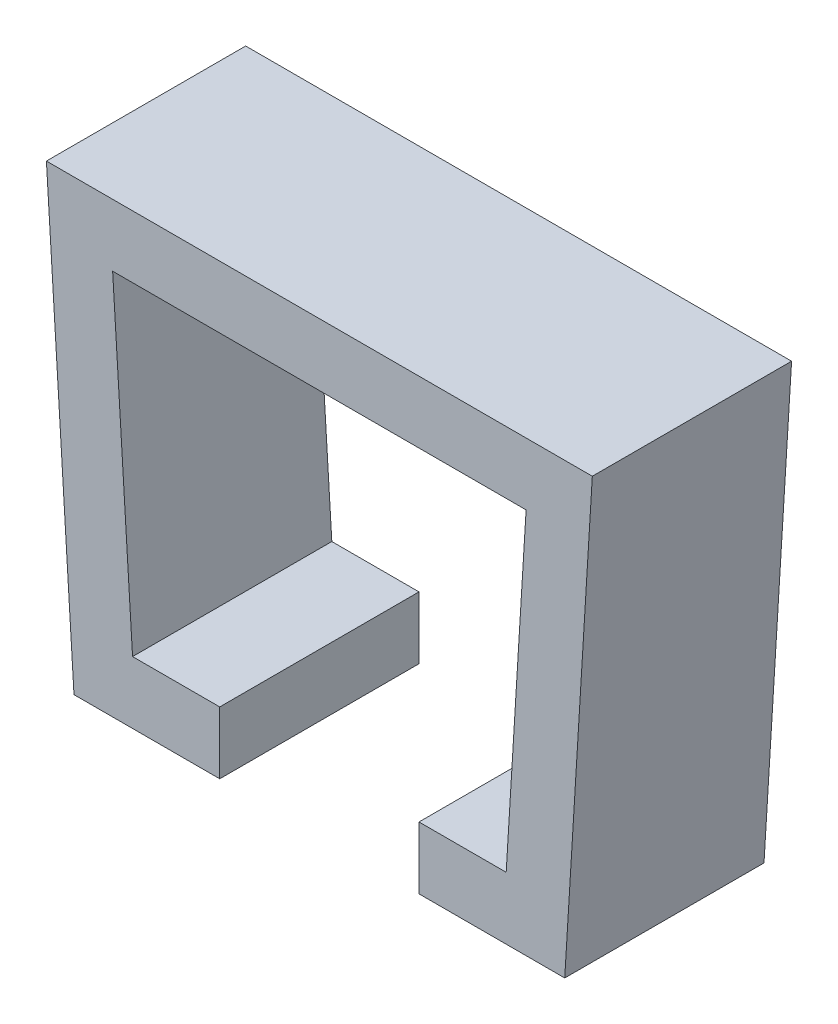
ISO-10303-21;
HEADER;
FILE_DESCRIPTION(('STEP AP214'),'2;1');
FILE_NAME('part.step','',(''),(''),'','','');
FILE_SCHEMA(('AUTOMOTIVE_DESIGN { 1 0 10303 214 1 1 1 1 }'));
ENDSEC;
DATA;
#1=APPLICATION_CONTEXT('core data for automotive mechanical design processes');
#2=APPLICATION_PROTOCOL_DEFINITION('international standard','automotive_design',2000,#1);
#3=PRODUCT_CONTEXT('',#1,'mechanical');
#4=PRODUCT('Part','Part','',(#3));
#5=PRODUCT_RELATED_PRODUCT_CATEGORY('part','',(#4));
#6=PRODUCT_DEFINITION_FORMATION('','',#4);
#7=PRODUCT_DEFINITION_CONTEXT('part definition',#1,'design');
#8=PRODUCT_DEFINITION('design','',#6,#7);
#9=PRODUCT_DEFINITION_SHAPE('','',#8);
#10=(LENGTH_UNIT() NAMED_UNIT(*) SI_UNIT(.MILLI.,.METRE.));
#11=(NAMED_UNIT(*) PLANE_ANGLE_UNIT() SI_UNIT($,.RADIAN.));
#12=(NAMED_UNIT(*) SI_UNIT($,.STERADIAN.) SOLID_ANGLE_UNIT());
#13=UNCERTAINTY_MEASURE_WITH_UNIT(LENGTH_MEASURE(1.E-05),#10,'distance_accuracy_value','');
#14=(GEOMETRIC_REPRESENTATION_CONTEXT(3) GLOBAL_UNCERTAINTY_ASSIGNED_CONTEXT((#13)) GLOBAL_UNIT_ASSIGNED_CONTEXT((#10,
#11,#12)) REPRESENTATION_CONTEXT('',''));
#15=CARTESIAN_POINT('',(0.,0.,0.));
#16=DIRECTION('',(0.,0.,1.));
#17=DIRECTION('',(1.,0.,0.));
#18=AXIS2_PLACEMENT_3D('',#15,#16,#17);
#19=CARTESIAN_POINT('',(-3.75,0.,4.));
#20=DIRECTION('',(0.,-1.,0.));
#21=DIRECTION('',(0.,0.,-1.));
#22=AXIS2_PLACEMENT_3D('',#19,#20,#21);
#23=PLANE('',#22);
#24=DIRECTION('',(-1.,0.,0.));
#25=VECTOR('',#24,1.);
#26=CARTESIAN_POINT('',(-3.75,0.,0.));
#27=LINE('',#26,#25);
#28=CARTESIAN_POINT('',(-2.,0.,0.));
#29=VERTEX_POINT('',#28);
#30=CARTESIAN_POINT('',(-3.75,0.,0.));
#31=VERTEX_POINT('',#30);
#32=EDGE_CURVE('E152',#29,#31,#27,.T.);
#33=ORIENTED_EDGE('',*,*,#32,.T.);
#34=DIRECTION('',(0.,0.,-1.));
#35=VECTOR('',#34,1.);
#36=CARTESIAN_POINT('',(-3.75,0.,4.));
#37=LINE('',#36,#35);
#38=CARTESIAN_POINT('',(-3.75,0.,4.));
#39=VERTEX_POINT('',#38);
#40=EDGE_CURVE('E11',#39,#31,#37,.T.);
#41=ORIENTED_EDGE('',*,*,#40,.F.);
#42=DIRECTION('',(-1.,0.,0.));
#43=VECTOR('',#42,1.);
#44=CARTESIAN_POINT('',(-3.75,0.,4.));
#45=LINE('',#44,#43);
#46=CARTESIAN_POINT('',(-2.,0.,4.));
#47=VERTEX_POINT('',#46);
#48=EDGE_CURVE('E174',#47,#39,#45,.T.);
#49=ORIENTED_EDGE('',*,*,#48,.F.);
#50=DIRECTION('',(0.,0.,-1.));
#51=VECTOR('',#50,1.);
#52=CARTESIAN_POINT('',(-2.,0.,4.));
#53=LINE('',#52,#51);
#54=EDGE_CURVE('E148',#47,#29,#53,.T.);
#55=ORIENTED_EDGE('',*,*,#54,.T.);
#56=EDGE_LOOP('',(#33,#41,#49,#55));
#57=FACE_BOUND('',#56,.T.);
#58=ADVANCED_FACE('F32',(#57),#23,.F.);
#59=CARTESIAN_POINT('',(-3.75,0.,4.));
#60=DIRECTION('',(-0.998111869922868,-0.0614222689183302,0.));
#61=DIRECTION('',(0.0614222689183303,-0.998111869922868,0.));
#62=AXIS2_PLACEMENT_3D('',#59,#60,#61);
#63=PLANE('',#62);
#64=DIRECTION('',(-0.0614222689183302,0.998111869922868,0.));
#65=VECTOR('',#64,1.);
#66=CARTESIAN_POINT('',(-3.75,0.,0.));
#67=LINE('',#66,#65);
#68=CARTESIAN_POINT('',(-4.15,6.5,0.));
#69=VERTEX_POINT('',#68);
#70=EDGE_CURVE('E155',#31,#69,#67,.T.);
#71=ORIENTED_EDGE('',*,*,#70,.T.);
#72=DIRECTION('',(0.,0.,-1.));
#73=VECTOR('',#72,1.);
#74=CARTESIAN_POINT('',(-4.15,6.5,4.));
#75=LINE('',#74,#73);
#76=CARTESIAN_POINT('',(-4.15,6.5,4.));
#77=VERTEX_POINT('',#76);
#78=EDGE_CURVE('E40',#77,#69,#75,.T.);
#79=ORIENTED_EDGE('',*,*,#78,.F.);
#80=DIRECTION('',(-0.0614222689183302,0.998111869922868,0.));
#81=VECTOR('',#80,1.);
#82=CARTESIAN_POINT('',(-3.75,0.,4.));
#83=LINE('',#82,#81);
#84=EDGE_CURVE('E103',#39,#77,#83,.T.);
#85=ORIENTED_EDGE('',*,*,#84,.F.);
#86=ORIENTED_EDGE('',*,*,#40,.T.);
#87=EDGE_LOOP('',(#71,#79,#85,#86));
#88=FACE_BOUND('',#87,.T.);
#89=ADVANCED_FACE('F252',(#88),#63,.F.);
#90=CARTESIAN_POINT('',(-4.15,6.5,4.));
#91=DIRECTION('',(0.,1.,0.));
#92=DIRECTION('',(0.,0.,1.));
#93=AXIS2_PLACEMENT_3D('',#90,#91,#92);
#94=PLANE('',#93);
#95=DIRECTION('',(1.,0.,0.));
#96=VECTOR('',#95,1.);
#97=CARTESIAN_POINT('',(-4.15,6.5,0.));
#98=LINE('',#97,#96);
#99=CARTESIAN_POINT('',(4.15,6.5,0.));
#100=VERTEX_POINT('',#99);
#101=EDGE_CURVE('E157',#69,#100,#98,.T.);
#102=ORIENTED_EDGE('',*,*,#101,.T.);
#103=DIRECTION('',(0.,0.,-1.));
#104=VECTOR('',#103,1.);
#105=CARTESIAN_POINT('',(4.15,6.5,4.));
#106=LINE('',#105,#104);
#107=CARTESIAN_POINT('',(4.15,6.5,4.));
#108=VERTEX_POINT('',#107);
#109=EDGE_CURVE('E193',#108,#100,#106,.T.);
#110=ORIENTED_EDGE('',*,*,#109,.F.);
#111=DIRECTION('',(1.,0.,0.));
#112=VECTOR('',#111,1.);
#113=CARTESIAN_POINT('',(-4.15,6.5,4.));
#114=LINE('',#113,#112);
#115=EDGE_CURVE('E201',#77,#108,#114,.T.);
#116=ORIENTED_EDGE('',*,*,#115,.F.);
#117=ORIENTED_EDGE('',*,*,#78,.T.);
#118=EDGE_LOOP('',(#102,#110,#116,#117));
#119=FACE_BOUND('',#118,.T.);
#120=ADVANCED_FACE('F199',(#119),#94,.F.);
#121=CARTESIAN_POINT('',(3.75,0.,4.));
#122=DIRECTION('',(0.998111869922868,-0.0614222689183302,0.));
#123=DIRECTION('',(0.0614222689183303,0.998111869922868,0.));
#124=AXIS2_PLACEMENT_3D('',#121,#122,#123);
#125=PLANE('',#124);
#126=DIRECTION('',(-0.0614222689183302,-0.998111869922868,0.));
#127=VECTOR('',#126,1.);
#128=CARTESIAN_POINT('',(3.75,0.,0.));
#129=LINE('',#128,#127);
#130=CARTESIAN_POINT('',(3.75,0.,0.));
#131=VERTEX_POINT('',#130);
#132=EDGE_CURVE('E159',#100,#131,#129,.T.);
#133=ORIENTED_EDGE('',*,*,#132,.T.);
#134=DIRECTION('',(0.,0.,-1.));
#135=VECTOR('',#134,1.);
#136=CARTESIAN_POINT('',(3.75,0.,4.));
#137=LINE('',#136,#135);
#138=CARTESIAN_POINT('',(3.75,0.,4.));
#139=VERTEX_POINT('',#138);
#140=EDGE_CURVE('E190',#139,#131,#137,.T.);
#141=ORIENTED_EDGE('',*,*,#140,.F.);
#142=DIRECTION('',(-0.0614222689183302,-0.998111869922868,0.));
#143=VECTOR('',#142,1.);
#144=CARTESIAN_POINT('',(3.75,0.,4.));
#145=LINE('',#144,#143);
#146=EDGE_CURVE('E219',#108,#139,#145,.T.);
#147=ORIENTED_EDGE('',*,*,#146,.F.);
#148=ORIENTED_EDGE('',*,*,#109,.T.);
#149=EDGE_LOOP('',(#133,#141,#147,#148));
#150=FACE_BOUND('',#149,.T.);
#151=ADVANCED_FACE('F210',(#150),#125,.F.);
#152=CARTESIAN_POINT('',(3.75,0.,4.));
#153=DIRECTION('',(0.,-1.,0.));
#154=DIRECTION('',(0.,0.,-1.));
#155=AXIS2_PLACEMENT_3D('',#152,#153,#154);
#156=PLANE('',#155);
#157=DIRECTION('',(-1.,0.,0.));
#158=VECTOR('',#157,1.);
#159=CARTESIAN_POINT('',(3.75,0.,0.));
#160=LINE('',#159,#158);
#161=CARTESIAN_POINT('',(2.,0.,0.));
#162=VERTEX_POINT('',#161);
#163=EDGE_CURVE('E161',#131,#162,#160,.T.);
#164=ORIENTED_EDGE('',*,*,#163,.T.);
#165=DIRECTION('',(0.,0.,-1.));
#166=VECTOR('',#165,1.);
#167=CARTESIAN_POINT('',(2.,0.,4.));
#168=LINE('',#167,#166);
#169=CARTESIAN_POINT('',(2.,0.,4.));
#170=VERTEX_POINT('',#169);
#171=EDGE_CURVE('E187',#170,#162,#168,.T.);
#172=ORIENTED_EDGE('',*,*,#171,.F.);
#173=DIRECTION('',(-1.,0.,0.));
#174=VECTOR('',#173,1.);
#175=CARTESIAN_POINT('',(3.75,0.,4.));
#176=LINE('',#175,#174);
#177=EDGE_CURVE('E216',#139,#170,#176,.T.);
#178=ORIENTED_EDGE('',*,*,#177,.F.);
#179=ORIENTED_EDGE('',*,*,#140,.T.);
#180=EDGE_LOOP('',(#164,#172,#178,#179));
#181=FACE_BOUND('',#180,.T.);
#182=ADVANCED_FACE('F214',(#181),#156,.F.);
#183=CARTESIAN_POINT('',(2.,0.,4.));
#184=DIRECTION('',(1.,0.,0.));
#185=DIRECTION('',(0.,0.,-1.));
#186=AXIS2_PLACEMENT_3D('',#183,#184,#185);
#187=PLANE('',#186);
#188=DIRECTION('',(0.,-1.,0.));
#189=VECTOR('',#188,1.);
#190=CARTESIAN_POINT('',(2.,0.,0.));
#191=LINE('',#190,#189);
#192=CARTESIAN_POINT('',(2.,-1.25,0.));
#193=VERTEX_POINT('',#192);
#194=EDGE_CURVE('E163',#162,#193,#191,.T.);
#195=ORIENTED_EDGE('',*,*,#194,.T.);
#196=DIRECTION('',(0.,0.,-1.));
#197=VECTOR('',#196,1.);
#198=CARTESIAN_POINT('',(2.,-1.25,4.));
#199=LINE('',#198,#197);
#200=CARTESIAN_POINT('',(2.,-1.25,4.));
#201=VERTEX_POINT('',#200);
#202=EDGE_CURVE('E184',#201,#193,#199,.T.);
#203=ORIENTED_EDGE('',*,*,#202,.F.);
#204=DIRECTION('',(0.,-1.,0.));
#205=VECTOR('',#204,1.);
#206=CARTESIAN_POINT('',(2.,0.,4.));
#207=LINE('',#206,#205);
#208=EDGE_CURVE('E218',#170,#201,#207,.T.);
#209=ORIENTED_EDGE('',*,*,#208,.F.);
#210=ORIENTED_EDGE('',*,*,#171,.T.);
#211=EDGE_LOOP('',(#195,#203,#209,#210));
#212=FACE_BOUND('',#211,.T.);
#213=ADVANCED_FACE('F265',(#212),#187,.F.);
#214=CARTESIAN_POINT('',(4.9254415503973,-1.25,4.));
#215=DIRECTION('',(0.,1.,0.));
#216=DIRECTION('',(-1.,0.,0.));
#217=AXIS2_PLACEMENT_3D('',#214,#215,#216);
#218=PLANE('',#217);
#219=DIRECTION('',(1.,0.,0.));
#220=VECTOR('',#219,1.);
#221=CARTESIAN_POINT('',(4.9254415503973,-1.25,0.));
#222=LINE('',#221,#220);
#223=CARTESIAN_POINT('',(4.9254415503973,-1.25,0.));
#224=VERTEX_POINT('',#223);
#225=EDGE_CURVE('E165',#193,#224,#222,.T.);
#226=ORIENTED_EDGE('',*,*,#225,.T.);
#227=DIRECTION('',(0.,0.,-1.));
#228=VECTOR('',#227,1.);
#229=CARTESIAN_POINT('',(4.9254415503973,-1.25,4.));
#230=LINE('',#229,#228);
#231=CARTESIAN_POINT('',(4.9254415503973,-1.25,4.));
#232=VERTEX_POINT('',#231);
#233=EDGE_CURVE('E181',#232,#224,#230,.T.);
#234=ORIENTED_EDGE('',*,*,#233,.F.);
#235=DIRECTION('',(1.,0.,0.));
#236=VECTOR('',#235,1.);
#237=CARTESIAN_POINT('',(4.9254415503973,-1.25,4.));
#238=LINE('',#237,#236);
#239=EDGE_CURVE('E221',#201,#232,#238,.T.);
#240=ORIENTED_EDGE('',*,*,#239,.F.);
#241=ORIENTED_EDGE('',*,*,#202,.T.);
#242=EDGE_LOOP('',(#226,#234,#240,#241));
#243=FACE_BOUND('',#242,.T.);
#244=ADVANCED_FACE('F268',(#243),#218,.F.);
#245=CARTESIAN_POINT('',(4.9254415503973,-1.25,4.));
#246=DIRECTION('',(-0.998111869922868,0.0614222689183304,0.));
#247=DIRECTION('',(-0.0614222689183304,-0.998111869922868,0.));
#248=AXIS2_PLACEMENT_3D('',#245,#246,#247);
#249=PLANE('',#248);
#250=DIRECTION('',(0.0614222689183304,0.998111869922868,0.));
#251=VECTOR('',#250,1.);
#252=CARTESIAN_POINT('',(4.9254415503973,-1.25,0.));
#253=LINE('',#252,#251);
#254=CARTESIAN_POINT('',(5.47928770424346,7.75,0.));
#255=VERTEX_POINT('',#254);
#256=EDGE_CURVE('E167',#224,#255,#253,.T.);
#257=ORIENTED_EDGE('',*,*,#256,.T.);
#258=DIRECTION('',(0.,0.,-1.));
#259=VECTOR('',#258,1.);
#260=CARTESIAN_POINT('',(5.47928770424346,7.75,4.));
#261=LINE('',#260,#259);
#262=CARTESIAN_POINT('',(5.47928770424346,7.75,4.));
#263=VERTEX_POINT('',#262);
#264=EDGE_CURVE('E178',#263,#255,#261,.T.);
#265=ORIENTED_EDGE('',*,*,#264,.F.);
#266=DIRECTION('',(0.0614222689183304,0.998111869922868,0.));
#267=VECTOR('',#266,1.);
#268=CARTESIAN_POINT('',(4.9254415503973,-1.25,4.));
#269=LINE('',#268,#267);
#270=EDGE_CURVE('E227',#232,#263,#269,.T.);
#271=ORIENTED_EDGE('',*,*,#270,.F.);
#272=ORIENTED_EDGE('',*,*,#233,.T.);
#273=EDGE_LOOP('',(#257,#265,#271,#272));
#274=FACE_BOUND('',#273,.T.);
#275=ADVANCED_FACE('F233',(#274),#249,.F.);
#276=CARTESIAN_POINT('',(-5.47928770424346,7.75,4.));
#277=DIRECTION('',(0.,-1.,0.));
#278=DIRECTION('',(0.,0.,-1.));
#279=AXIS2_PLACEMENT_3D('',#276,#277,#278);
#280=PLANE('',#279);
#281=DIRECTION('',(-1.,0.,0.));
#282=VECTOR('',#281,1.);
#283=CARTESIAN_POINT('',(-5.47928770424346,7.75,0.));
#284=LINE('',#283,#282);
#285=CARTESIAN_POINT('',(-5.47928770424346,7.75,0.));
#286=VERTEX_POINT('',#285);
#287=EDGE_CURVE('E169',#255,#286,#284,.T.);
#288=ORIENTED_EDGE('',*,*,#287,.T.);
#289=DIRECTION('',(0.,0.,-1.));
#290=VECTOR('',#289,1.);
#291=CARTESIAN_POINT('',(-5.47928770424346,7.75,4.));
#292=LINE('',#291,#290);
#293=CARTESIAN_POINT('',(-5.47928770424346,7.75,4.));
#294=VERTEX_POINT('',#293);
#295=EDGE_CURVE('E143',#294,#286,#292,.T.);
#296=ORIENTED_EDGE('',*,*,#295,.F.);
#297=DIRECTION('',(-1.,0.,0.));
#298=VECTOR('',#297,1.);
#299=CARTESIAN_POINT('',(-5.47928770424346,7.75,4.));
#300=LINE('',#299,#298);
#301=EDGE_CURVE('E134',#263,#294,#300,.T.);
#302=ORIENTED_EDGE('',*,*,#301,.F.);
#303=ORIENTED_EDGE('',*,*,#264,.T.);
#304=EDGE_LOOP('',(#288,#296,#302,#303));
#305=FACE_BOUND('',#304,.T.);
#306=ADVANCED_FACE('F237',(#305),#280,.F.);
#307=CARTESIAN_POINT('',(-4.9254415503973,-1.25,4.));
#308=DIRECTION('',(0.998111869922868,0.0614222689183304,0.));
#309=DIRECTION('',(-0.0614222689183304,0.998111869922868,0.));
#310=AXIS2_PLACEMENT_3D('',#307,#308,#309);
#311=PLANE('',#310);
#312=DIRECTION('',(0.0614222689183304,-0.998111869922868,0.));
#313=VECTOR('',#312,1.);
#314=CARTESIAN_POINT('',(-4.9254415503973,-1.25,0.));
#315=LINE('',#314,#313);
#316=CARTESIAN_POINT('',(-4.9254415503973,-1.25,0.));
#317=VERTEX_POINT('',#316);
#318=EDGE_CURVE('E142',#286,#317,#315,.T.);
#319=ORIENTED_EDGE('',*,*,#318,.T.);
#320=DIRECTION('',(0.,0.,-1.));
#321=VECTOR('',#320,1.);
#322=CARTESIAN_POINT('',(-4.9254415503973,-1.25,4.));
#323=LINE('',#322,#321);
#324=CARTESIAN_POINT('',(-4.9254415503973,-1.25,4.));
#325=VERTEX_POINT('',#324);
#326=EDGE_CURVE('E139',#325,#317,#323,.T.);
#327=ORIENTED_EDGE('',*,*,#326,.F.);
#328=DIRECTION('',(0.0614222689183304,-0.998111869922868,0.));
#329=VECTOR('',#328,1.);
#330=CARTESIAN_POINT('',(-4.9254415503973,-1.25,4.));
#331=LINE('',#330,#329);
#332=EDGE_CURVE('E128',#294,#325,#331,.T.);
#333=ORIENTED_EDGE('',*,*,#332,.F.);
#334=ORIENTED_EDGE('',*,*,#295,.T.);
#335=EDGE_LOOP('',(#319,#327,#333,#334));
#336=FACE_BOUND('',#335,.T.);
#337=ADVANCED_FACE('F140',(#336),#311,.F.);
#338=CARTESIAN_POINT('',(-4.9254415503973,-1.25,4.));
#339=DIRECTION('',(0.,1.,0.));
#340=DIRECTION('',(0.,0.,1.));
#341=AXIS2_PLACEMENT_3D('',#338,#339,#340);
#342=PLANE('',#341);
#343=DIRECTION('',(1.,0.,0.));
#344=VECTOR('',#343,1.);
#345=CARTESIAN_POINT('',(-4.9254415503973,-1.25,0.));
#346=LINE('',#345,#344);
#347=CARTESIAN_POINT('',(-2.,-1.25,0.));
#348=VERTEX_POINT('',#347);
#349=EDGE_CURVE('E89',#317,#348,#346,.T.);
#350=ORIENTED_EDGE('',*,*,#349,.T.);
#351=DIRECTION('',(0.,0.,-1.));
#352=VECTOR('',#351,1.);
#353=CARTESIAN_POINT('',(-2.,-1.25,4.));
#354=LINE('',#353,#352);
#355=CARTESIAN_POINT('',(-2.,-1.25,4.));
#356=VERTEX_POINT('',#355);
#357=EDGE_CURVE('E144',#356,#348,#354,.T.);
#358=ORIENTED_EDGE('',*,*,#357,.F.);
#359=DIRECTION('',(1.,0.,0.));
#360=VECTOR('',#359,1.);
#361=CARTESIAN_POINT('',(-4.9254415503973,-1.25,4.));
#362=LINE('',#361,#360);
#363=EDGE_CURVE('E132',#325,#356,#362,.T.);
#364=ORIENTED_EDGE('',*,*,#363,.F.);
#365=ORIENTED_EDGE('',*,*,#326,.T.);
#366=EDGE_LOOP('',(#350,#358,#364,#365));
#367=FACE_BOUND('',#366,.T.);
#368=ADVANCED_FACE('F146',(#367),#342,.F.);
#369=CARTESIAN_POINT('',(-2.,0.,4.));
#370=DIRECTION('',(-1.,0.,0.));
#371=DIRECTION('',(0.,0.,1.));
#372=AXIS2_PLACEMENT_3D('',#369,#370,#371);
#373=PLANE('',#372);
#374=DIRECTION('',(0.,1.,0.));
#375=VECTOR('',#374,1.);
#376=CARTESIAN_POINT('',(-2.,0.,0.));
#377=LINE('',#376,#375);
#378=EDGE_CURVE('E95',#348,#29,#377,.T.);
#379=ORIENTED_EDGE('',*,*,#378,.T.);
#380=ORIENTED_EDGE('',*,*,#54,.F.);
#381=DIRECTION('',(0.,1.,0.));
#382=VECTOR('',#381,1.);
#383=CARTESIAN_POINT('',(-2.,0.,4.));
#384=LINE('',#383,#382);
#385=EDGE_CURVE('E48',#356,#47,#384,.T.);
#386=ORIENTED_EDGE('',*,*,#385,.F.);
#387=ORIENTED_EDGE('',*,*,#357,.T.);
#388=EDGE_LOOP('',(#379,#380,#386,#387));
#389=FACE_BOUND('',#388,.T.);
#390=ADVANCED_FACE('F241',(#389),#373,.F.);
#391=CARTESIAN_POINT('',(0.,0.,4.));
#392=DIRECTION('',(0.,0.,-1.));
#393=DIRECTION('',(-1.,0.,0.));
#394=AXIS2_PLACEMENT_3D('',#391,#392,#393);
#395=PLANE('',#394);
#396=ORIENTED_EDGE('',*,*,#48,.T.);
#397=ORIENTED_EDGE('',*,*,#84,.T.);
#398=ORIENTED_EDGE('',*,*,#115,.T.);
#399=ORIENTED_EDGE('',*,*,#146,.T.);
#400=ORIENTED_EDGE('',*,*,#177,.T.);
#401=ORIENTED_EDGE('',*,*,#208,.T.);
#402=ORIENTED_EDGE('',*,*,#239,.T.);
#403=ORIENTED_EDGE('',*,*,#270,.T.);
#404=ORIENTED_EDGE('',*,*,#301,.T.);
#405=ORIENTED_EDGE('',*,*,#332,.T.);
#406=ORIENTED_EDGE('',*,*,#363,.T.);
#407=ORIENTED_EDGE('',*,*,#385,.T.);
#408=EDGE_LOOP('',(#396,#397,#398,#399,#400,#401,#402,#403,#404,#405,#406,#407));
#409=FACE_BOUND('',#408,.T.);
#410=ADVANCED_FACE('F130',(#409),#395,.F.);
#411=CARTESIAN_POINT('',(0.,0.,0.));
#412=DIRECTION('',(0.,0.,-1.));
#413=DIRECTION('',(-1.,0.,0.));
#414=AXIS2_PLACEMENT_3D('',#411,#412,#413);
#415=PLANE('',#414);
#416=ORIENTED_EDGE('',*,*,#32,.F.);
#417=ORIENTED_EDGE('',*,*,#378,.F.);
#418=ORIENTED_EDGE('',*,*,#349,.F.);
#419=ORIENTED_EDGE('',*,*,#318,.F.);
#420=ORIENTED_EDGE('',*,*,#287,.F.);
#421=ORIENTED_EDGE('',*,*,#256,.F.);
#422=ORIENTED_EDGE('',*,*,#225,.F.);
#423=ORIENTED_EDGE('',*,*,#194,.F.);
#424=ORIENTED_EDGE('',*,*,#163,.F.);
#425=ORIENTED_EDGE('',*,*,#132,.F.);
#426=ORIENTED_EDGE('',*,*,#101,.F.);
#427=ORIENTED_EDGE('',*,*,#70,.F.);
#428=EDGE_LOOP('',(#416,#417,#418,#419,#420,#421,#422,#423,#424,#425,#426,#427));
#429=FACE_BOUND('',#428,.T.);
#430=ADVANCED_FACE('F205',(#429),#415,.T.);
#431=CLOSED_SHELL('',(#58,#89,#120,#151,#182,#213,#244,#275,#306,#337,#368,#390,#410,#430));
#432=MANIFOLD_SOLID_BREP('B2',#431);
#433=ADVANCED_BREP_SHAPE_REPRESENTATION('',(#18,#432),#14);
#434=SHAPE_DEFINITION_REPRESENTATION(#9,#433);
ENDSEC;
END-ISO-10303-21;
